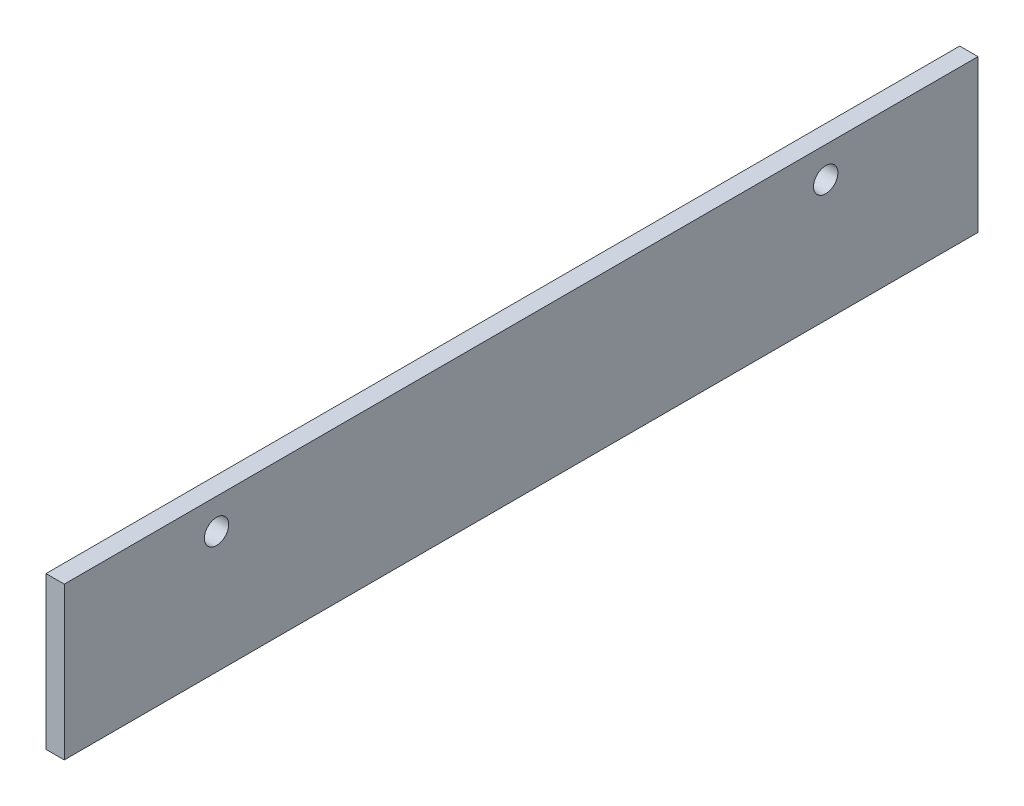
ISO-10303-21;
HEADER;
FILE_DESCRIPTION(('STEP AP214'),'2;1');
FILE_NAME('part.step','',(''),(''),'','','');
FILE_SCHEMA(('AUTOMOTIVE_DESIGN { 1 0 10303 214 1 1 1 1 }'));
ENDSEC;
DATA;
#1=APPLICATION_CONTEXT('core data for automotive mechanical design processes');
#2=APPLICATION_PROTOCOL_DEFINITION('international standard','automotive_design',2000,#1);
#3=PRODUCT_CONTEXT('',#1,'mechanical');
#4=PRODUCT('Part','Part','',(#3));
#5=PRODUCT_RELATED_PRODUCT_CATEGORY('part','',(#4));
#6=PRODUCT_DEFINITION_FORMATION('','',#4);
#7=PRODUCT_DEFINITION_CONTEXT('part definition',#1,'design');
#8=PRODUCT_DEFINITION('design','',#6,#7);
#9=PRODUCT_DEFINITION_SHAPE('','',#8);
#10=(LENGTH_UNIT() NAMED_UNIT(*) SI_UNIT(.MILLI.,.METRE.));
#11=(NAMED_UNIT(*) PLANE_ANGLE_UNIT() SI_UNIT($,.RADIAN.));
#12=(NAMED_UNIT(*) SI_UNIT($,.STERADIAN.) SOLID_ANGLE_UNIT());
#13=UNCERTAINTY_MEASURE_WITH_UNIT(LENGTH_MEASURE(1.E-05),#10,'distance_accuracy_value','');
#14=(GEOMETRIC_REPRESENTATION_CONTEXT(3) GLOBAL_UNCERTAINTY_ASSIGNED_CONTEXT((#13)) GLOBAL_UNIT_ASSIGNED_CONTEXT((#10,
#11,#12)) REPRESENTATION_CONTEXT('',''));
#15=CARTESIAN_POINT('',(0.,0.,0.));
#16=DIRECTION('',(0.,0.,1.));
#17=DIRECTION('',(1.,0.,0.));
#18=AXIS2_PLACEMENT_3D('',#15,#16,#17);
#19=CARTESIAN_POINT('',(6.,25.,150.));
#20=DIRECTION('',(0.,0.,-1.));
#21=DIRECTION('',(-1.,0.,0.));
#22=AXIS2_PLACEMENT_3D('',#19,#20,#21);
#23=PLANE('',#22);
#24=DIRECTION('',(0.,-1.,0.));
#25=VECTOR('',#24,1.);
#26=CARTESIAN_POINT('',(0.,25.,150.));
#27=LINE('',#26,#25);
#28=CARTESIAN_POINT('',(0.,25.,150.));
#29=VERTEX_POINT('',#28);
#30=CARTESIAN_POINT('',(0.,-25.,150.));
#31=VERTEX_POINT('',#30);
#32=EDGE_CURVE('E70',#29,#31,#27,.T.);
#33=ORIENTED_EDGE('',*,*,#32,.T.);
#34=DIRECTION('',(-1.,0.,0.));
#35=VECTOR('',#34,1.);
#36=CARTESIAN_POINT('',(6.,-25.,150.));
#37=LINE('',#36,#35);
#38=CARTESIAN_POINT('',(6.,-25.,150.));
#39=VERTEX_POINT('',#38);
#40=EDGE_CURVE('E11',#39,#31,#37,.T.);
#41=ORIENTED_EDGE('',*,*,#40,.F.);
#42=DIRECTION('',(0.,-1.,0.));
#43=VECTOR('',#42,1.);
#44=CARTESIAN_POINT('',(6.,25.,150.));
#45=LINE('',#44,#43);
#46=CARTESIAN_POINT('',(6.,25.,150.));
#47=VERTEX_POINT('',#46);
#48=EDGE_CURVE('E93',#47,#39,#45,.T.);
#49=ORIENTED_EDGE('',*,*,#48,.F.);
#50=DIRECTION('',(-1.,0.,0.));
#51=VECTOR('',#50,1.);
#52=CARTESIAN_POINT('',(6.,25.,150.));
#53=LINE('',#52,#51);
#54=EDGE_CURVE('E82',#47,#29,#53,.T.);
#55=ORIENTED_EDGE('',*,*,#54,.T.);
#56=EDGE_LOOP('',(#33,#41,#49,#55));
#57=FACE_BOUND('',#56,.T.);
#58=ADVANCED_FACE('F26',(#57),#23,.F.);
#59=CARTESIAN_POINT('',(6.,-25.,150.));
#60=DIRECTION('',(0.,1.,0.));
#61=DIRECTION('',(0.,0.,1.));
#62=AXIS2_PLACEMENT_3D('',#59,#60,#61);
#63=PLANE('',#62);
#64=DIRECTION('',(0.,0.,-1.));
#65=VECTOR('',#64,1.);
#66=CARTESIAN_POINT('',(0.,-25.,150.));
#67=LINE('',#66,#65);
#68=CARTESIAN_POINT('',(0.,-25.,-150.));
#69=VERTEX_POINT('',#68);
#70=EDGE_CURVE('E66',#31,#69,#67,.T.);
#71=ORIENTED_EDGE('',*,*,#70,.T.);
#72=DIRECTION('',(-1.,0.,0.));
#73=VECTOR('',#72,1.);
#74=CARTESIAN_POINT('',(6.,-25.,-150.));
#75=LINE('',#74,#73);
#76=CARTESIAN_POINT('',(6.,-25.,-150.));
#77=VERTEX_POINT('',#76);
#78=EDGE_CURVE('E33',#77,#69,#75,.T.);
#79=ORIENTED_EDGE('',*,*,#78,.F.);
#80=DIRECTION('',(0.,0.,-1.));
#81=VECTOR('',#80,1.);
#82=CARTESIAN_POINT('',(6.,-25.,150.));
#83=LINE('',#82,#81);
#84=EDGE_CURVE('E78',#39,#77,#83,.T.);
#85=ORIENTED_EDGE('',*,*,#84,.F.);
#86=ORIENTED_EDGE('',*,*,#40,.T.);
#87=EDGE_LOOP('',(#71,#79,#85,#86));
#88=FACE_BOUND('',#87,.T.);
#89=ADVANCED_FACE('F77',(#88),#63,.F.);
#90=CARTESIAN_POINT('',(6.,25.,-150.));
#91=DIRECTION('',(0.,0.,1.));
#92=DIRECTION('',(1.,0.,0.));
#93=AXIS2_PLACEMENT_3D('',#90,#91,#92);
#94=PLANE('',#93);
#95=DIRECTION('',(0.,1.,0.));
#96=VECTOR('',#95,1.);
#97=CARTESIAN_POINT('',(0.,25.,-150.));
#98=LINE('',#97,#96);
#99=CARTESIAN_POINT('',(0.,25.,-150.));
#100=VERTEX_POINT('',#99);
#101=EDGE_CURVE('E71',#69,#100,#98,.T.);
#102=ORIENTED_EDGE('',*,*,#101,.T.);
#103=DIRECTION('',(-1.,0.,0.));
#104=VECTOR('',#103,1.);
#105=CARTESIAN_POINT('',(6.,25.,-150.));
#106=LINE('',#105,#104);
#107=CARTESIAN_POINT('',(6.,25.,-150.));
#108=VERTEX_POINT('',#107);
#109=EDGE_CURVE('E99',#108,#100,#106,.T.);
#110=ORIENTED_EDGE('',*,*,#109,.F.);
#111=DIRECTION('',(0.,1.,0.));
#112=VECTOR('',#111,1.);
#113=CARTESIAN_POINT('',(6.,25.,-150.));
#114=LINE('',#113,#112);
#115=EDGE_CURVE('E45',#77,#108,#114,.T.);
#116=ORIENTED_EDGE('',*,*,#115,.F.);
#117=ORIENTED_EDGE('',*,*,#78,.T.);
#118=EDGE_LOOP('',(#102,#110,#116,#117));
#119=FACE_BOUND('',#118,.T.);
#120=ADVANCED_FACE('F102',(#119),#94,.F.);
#121=CARTESIAN_POINT('',(6.,25.,150.));
#122=DIRECTION('',(0.,-1.,0.));
#123=DIRECTION('',(0.,0.,-1.));
#124=AXIS2_PLACEMENT_3D('',#121,#122,#123);
#125=PLANE('',#124);
#126=DIRECTION('',(0.,0.,1.));
#127=VECTOR('',#126,1.);
#128=CARTESIAN_POINT('',(0.,25.,150.));
#129=LINE('',#128,#127);
#130=EDGE_CURVE('E91',#100,#29,#129,.T.);
#131=ORIENTED_EDGE('',*,*,#130,.T.);
#132=ORIENTED_EDGE('',*,*,#54,.F.);
#133=DIRECTION('',(0.,0.,1.));
#134=VECTOR('',#133,1.);
#135=CARTESIAN_POINT('',(6.,25.,150.));
#136=LINE('',#135,#134);
#137=EDGE_CURVE('E40',#108,#47,#136,.T.);
#138=ORIENTED_EDGE('',*,*,#137,.F.);
#139=ORIENTED_EDGE('',*,*,#109,.T.);
#140=EDGE_LOOP('',(#131,#132,#138,#139));
#141=FACE_BOUND('',#140,.T.);
#142=ADVANCED_FACE('F104',(#141),#125,.F.);
#143=CARTESIAN_POINT('',(6.,-25.,150.));
#144=DIRECTION('',(1.,0.,0.));
#145=DIRECTION('',(0.,0.,-1.));
#146=AXIS2_PLACEMENT_3D('',#143,#144,#145);
#147=PLANE('',#146);
#148=CARTESIAN_POINT('',(6.,15.0000000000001,-100.));
#149=DIRECTION('',(1.,0.,0.));
#150=DIRECTION('',(0.,0.,1.));
#151=AXIS2_PLACEMENT_3D('',#148,#149,#150);
#152=CIRCLE('',#151,4.00000000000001);
#153=CARTESIAN_POINT('',(6.,15.0000000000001,-96.));
#154=VERTEX_POINT('',#153);
#155=EDGE_CURVE('E161',#154,#154,#152,.T.);
#156=ORIENTED_EDGE('',*,*,#155,.F.);
#157=EDGE_LOOP('',(#156));
#158=FACE_BOUND('',#157,.T.);
#159=CARTESIAN_POINT('',(6.,15.0000000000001,100.));
#160=DIRECTION('',(1.,0.,0.));
#161=DIRECTION('',(0.,0.,-1.));
#162=AXIS2_PLACEMENT_3D('',#159,#160,#161);
#163=CIRCLE('',#162,4.00000000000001);
#164=CARTESIAN_POINT('',(6.,15.0000000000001,96.));
#165=VERTEX_POINT('',#164);
#166=EDGE_CURVE('E86',#165,#165,#163,.T.);
#167=ORIENTED_EDGE('',*,*,#166,.F.);
#168=EDGE_LOOP('',(#167));
#169=FACE_BOUND('',#168,.T.);
#170=ORIENTED_EDGE('',*,*,#48,.T.);
#171=ORIENTED_EDGE('',*,*,#84,.T.);
#172=ORIENTED_EDGE('',*,*,#115,.T.);
#173=ORIENTED_EDGE('',*,*,#137,.T.);
#174=EDGE_LOOP('',(#170,#171,#172,#173));
#175=FACE_BOUND('',#174,.T.);
#176=ADVANCED_FACE('F105',(#158,#169,#175),#147,.T.);
#177=CARTESIAN_POINT('',(0.,-25.,150.));
#178=DIRECTION('',(1.,0.,0.));
#179=DIRECTION('',(0.,0.,-1.));
#180=AXIS2_PLACEMENT_3D('',#177,#178,#179);
#181=PLANE('',#180);
#182=CARTESIAN_POINT('',(0.,15.0000000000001,-100.));
#183=DIRECTION('',(1.,0.,0.));
#184=DIRECTION('',(0.,0.,1.));
#185=AXIS2_PLACEMENT_3D('',#182,#183,#184);
#186=CIRCLE('',#185,4.00000000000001);
#187=CARTESIAN_POINT('',(0.,15.0000000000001,-96.));
#188=VERTEX_POINT('',#187);
#189=EDGE_CURVE('E159',#188,#188,#186,.T.);
#190=ORIENTED_EDGE('',*,*,#189,.T.);
#191=EDGE_LOOP('',(#190));
#192=FACE_BOUND('',#191,.T.);
#193=CARTESIAN_POINT('',(0.,15.0000000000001,100.));
#194=DIRECTION('',(1.,0.,0.));
#195=DIRECTION('',(0.,0.,-1.));
#196=AXIS2_PLACEMENT_3D('',#193,#194,#195);
#197=CIRCLE('',#196,4.00000000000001);
#198=CARTESIAN_POINT('',(0.,15.0000000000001,96.));
#199=VERTEX_POINT('',#198);
#200=EDGE_CURVE('E83',#199,#199,#197,.T.);
#201=ORIENTED_EDGE('',*,*,#200,.T.);
#202=EDGE_LOOP('',(#201));
#203=FACE_BOUND('',#202,.T.);
#204=ORIENTED_EDGE('',*,*,#32,.F.);
#205=ORIENTED_EDGE('',*,*,#130,.F.);
#206=ORIENTED_EDGE('',*,*,#101,.F.);
#207=ORIENTED_EDGE('',*,*,#70,.F.);
#208=EDGE_LOOP('',(#204,#205,#206,#207));
#209=FACE_BOUND('',#208,.T.);
#210=ADVANCED_FACE('F67',(#192,#203,#209),#181,.F.);
#211=CARTESIAN_POINT('',(0.,15.0000000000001,100.));
#212=DIRECTION('',(1.,0.,0.));
#213=DIRECTION('',(0.,0.,-1.));
#214=AXIS2_PLACEMENT_3D('',#211,#212,#213);
#215=CYLINDRICAL_SURFACE('',#214,4.00000000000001);
#216=ORIENTED_EDGE('',*,*,#200,.F.);
#217=EDGE_LOOP('',(#216));
#218=FACE_BOUND('',#217,.T.);
#219=ORIENTED_EDGE('',*,*,#166,.T.);
#220=EDGE_LOOP('',(#219));
#221=FACE_BOUND('',#220,.T.);
#222=ADVANCED_FACE('F113',(#218,#221),#215,.F.);
#223=CARTESIAN_POINT('',(0.,15.0000000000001,-100.));
#224=DIRECTION('',(1.,0.,0.));
#225=DIRECTION('',(0.,0.,-1.));
#226=AXIS2_PLACEMENT_3D('',#223,#224,#225);
#227=CYLINDRICAL_SURFACE('',#226,4.00000000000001);
#228=ORIENTED_EDGE('',*,*,#189,.F.);
#229=EDGE_LOOP('',(#228));
#230=FACE_BOUND('',#229,.T.);
#231=ORIENTED_EDGE('',*,*,#155,.T.);
#232=EDGE_LOOP('',(#231));
#233=FACE_BOUND('',#232,.T.);
#234=ADVANCED_FACE('F146',(#230,#233),#227,.F.);
#235=CLOSED_SHELL('',(#58,#89,#120,#142,#176,#210,#222,#234));
#236=MANIFOLD_SOLID_BREP('B2',#235);
#237=ADVANCED_BREP_SHAPE_REPRESENTATION('',(#18,#236),#14);
#238=SHAPE_DEFINITION_REPRESENTATION(#9,#237);
ENDSEC;
END-ISO-10303-21;
